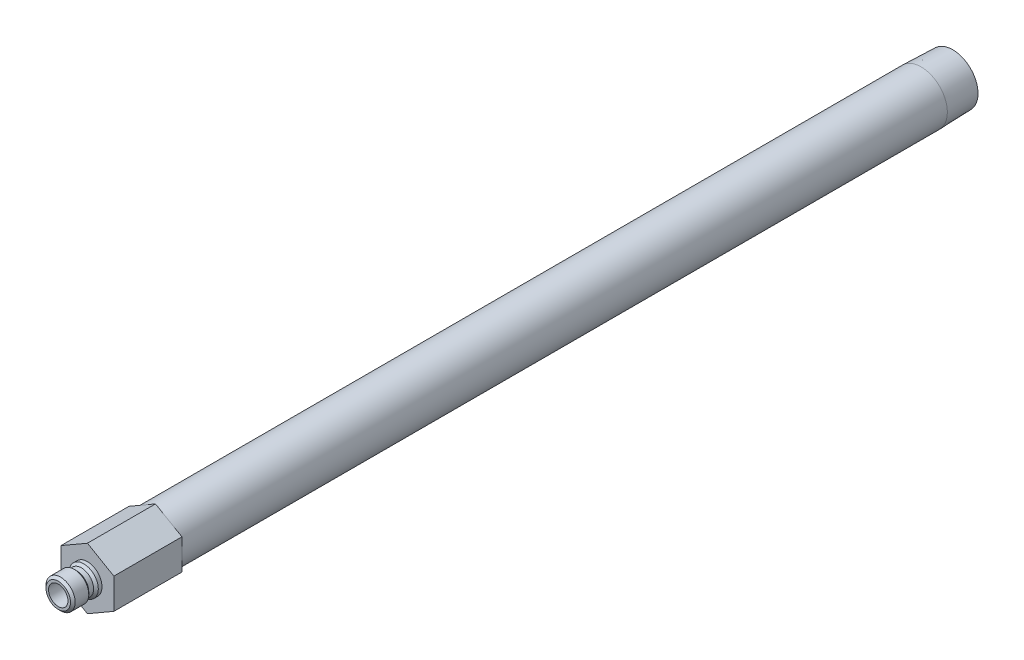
from build123d import *

# Parameters (mm, degrees)
SKETCH2_R           = 3.175
BOSS_EXTRUDE1_DEPTH = 22.225


with BuildPart() as part:
    # Sketch1 → Revolve1 (revolve)
    with BuildSketch(Plane(origin=(0, 0, 0), x_dir=(0, 0, -1), z_dir=(1, 0, 0))):
        Polygon((-9.525, 3.175), (-9.525, 4.0005), (-8.763, 4.7625), (-4.318, 4.7625), (-3.556, 4.0005), (-1.9685, 4.0005), (-1.2065, 4.7625), (0, 4.7625), (0, 8.5725), (272.2372, 8.5725), (282.575, 8.249445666), (282.575, 6.2611), (22.225, 6.2611), (22.225, 3.175), align=None)
    revolve(axis=Axis((0, 0, 0), (0, 0, 1)))

    # Sketch2 → Boss-Extrude1 (add)
    with BuildSketch(Plane.XY):
        Polygon((-8.636, 4.985996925), (-8.636, -4.985996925), (0, -9.971993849), (8.636, -4.985996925), (8.636, 4.985996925), (0, 9.971993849), align=None)
        with Locations(Location((0, 0, 0), (0, 0, 90))):
            Circle(SKETCH2_R, mode=Mode.SUBTRACT)
    extrude(amount=-BOSS_EXTRUDE1_DEPTH)


solid = part.part
